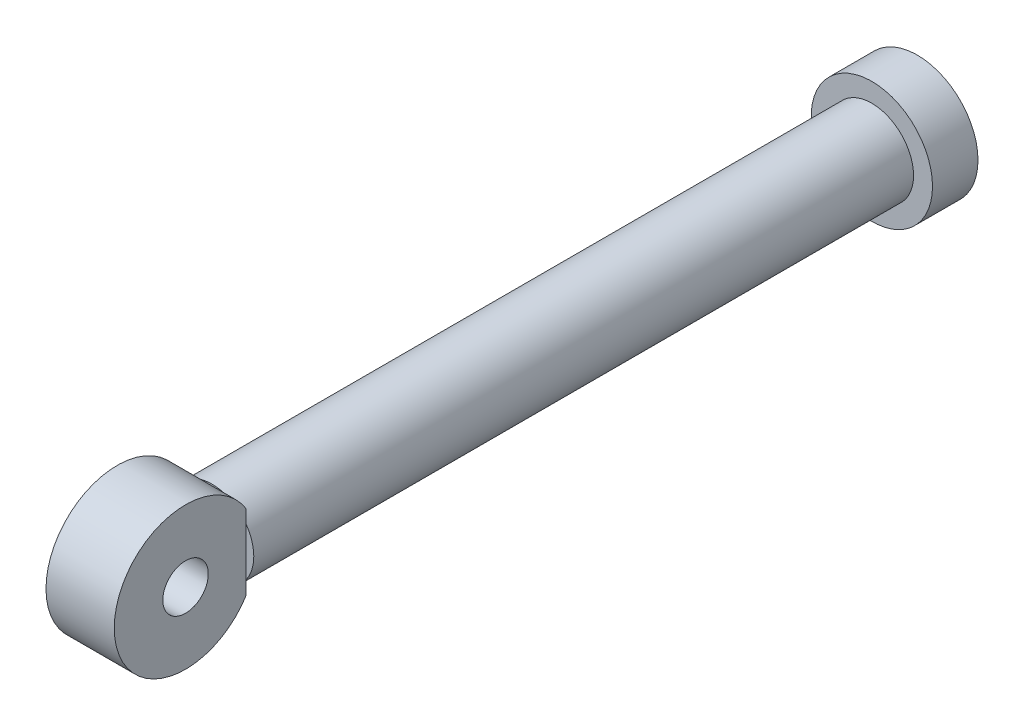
ISO-10303-21;
HEADER;
FILE_DESCRIPTION(('STEP AP214'),'2;1');
FILE_NAME('part.step','',(''),(''),'','','');
FILE_SCHEMA(('AUTOMOTIVE_DESIGN { 1 0 10303 214 1 1 1 1 }'));
ENDSEC;
DATA;
#1=APPLICATION_CONTEXT('core data for automotive mechanical design processes');
#2=APPLICATION_PROTOCOL_DEFINITION('international standard','automotive_design',2000,#1);
#3=PRODUCT_CONTEXT('',#1,'mechanical');
#4=PRODUCT('Part','Part','',(#3));
#5=PRODUCT_RELATED_PRODUCT_CATEGORY('part','',(#4));
#6=PRODUCT_DEFINITION_FORMATION('','',#4);
#7=PRODUCT_DEFINITION_CONTEXT('part definition',#1,'design');
#8=PRODUCT_DEFINITION('design','',#6,#7);
#9=PRODUCT_DEFINITION_SHAPE('','',#8);
#10=(LENGTH_UNIT() NAMED_UNIT(*) SI_UNIT(.MILLI.,.METRE.));
#11=(NAMED_UNIT(*) PLANE_ANGLE_UNIT() SI_UNIT($,.RADIAN.));
#12=(NAMED_UNIT(*) SI_UNIT($,.STERADIAN.) SOLID_ANGLE_UNIT());
#13=UNCERTAINTY_MEASURE_WITH_UNIT(LENGTH_MEASURE(1.E-05),#10,'distance_accuracy_value','');
#14=(GEOMETRIC_REPRESENTATION_CONTEXT(3) GLOBAL_UNCERTAINTY_ASSIGNED_CONTEXT((#13)) GLOBAL_UNIT_ASSIGNED_CONTEXT((#10,
#11,#12)) REPRESENTATION_CONTEXT('',''));
#15=CARTESIAN_POINT('',(0.,0.,0.));
#16=DIRECTION('',(0.,0.,1.));
#17=DIRECTION('',(1.,0.,0.));
#18=AXIS2_PLACEMENT_3D('',#15,#16,#17);
#19=CARTESIAN_POINT('',(0.,0.,465.));
#20=DIRECTION('',(0.,0.,1.));
#21=DIRECTION('',(1.,0.,0.));
#22=AXIS2_PLACEMENT_3D('',#19,#20,#21);
#23=PLANE('',#22);
#24=CARTESIAN_POINT('',(0.,0.,465.));
#25=DIRECTION('',(0.,0.,1.));
#26=DIRECTION('',(1.,0.,0.));
#27=AXIS2_PLACEMENT_3D('',#24,#25,#26);
#28=CIRCLE('',#27,27.5);
#29=CARTESIAN_POINT('',(-22.5,15.8113883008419,465.));
#30=VERTEX_POINT('',#29);
#31=CARTESIAN_POINT('',(-22.5,-15.8113883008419,465.));
#32=VERTEX_POINT('',#31);
#33=EDGE_CURVE('E150',#30,#32,#28,.T.);
#34=ORIENTED_EDGE('',*,*,#33,.T.);
#35=DIRECTION('',(0.,1.,0.));
#36=VECTOR('',#35,1.);
#37=CARTESIAN_POINT('',(-22.5,0.,465.));
#38=LINE('',#37,#36);
#39=EDGE_CURVE('E49',#32,#30,#38,.T.);
#40=ORIENTED_EDGE('',*,*,#39,.T.);
#41=EDGE_LOOP('',(#34,#40));
#42=FACE_BOUND('',#41,.T.);
#43=ADVANCED_FACE('F41',(#42),#23,.T.);
#44=CARTESIAN_POINT('',(12.1346610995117,24.6779253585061,465.));
#45=VERTEX_POINT('',#44);
#46=CARTESIAN_POINT('',(-12.1346610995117,24.6779253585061,465.));
#47=VERTEX_POINT('',#46);
#48=EDGE_CURVE('E137',#45,#47,#28,.T.);
#49=ORIENTED_EDGE('',*,*,#48,.T.);
#50=DIRECTION('',(-1.,0.,0.));
#51=VECTOR('',#50,1.);
#52=CARTESIAN_POINT('',(22.5,24.6779253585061,465.));
#53=LINE('',#52,#51);
#54=EDGE_CURVE('E145',#47,#45,#53,.F.);
#55=ORIENTED_EDGE('',*,*,#54,.T.);
#56=EDGE_LOOP('',(#49,#55));
#57=FACE_BOUND('',#56,.T.);
#58=ADVANCED_FACE('F175',(#57),#23,.T.);
#59=CARTESIAN_POINT('',(-12.1346610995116,-24.6779253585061,465.));
#60=VERTEX_POINT('',#59);
#61=CARTESIAN_POINT('',(12.1346610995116,-24.6779253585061,465.));
#62=VERTEX_POINT('',#61);
#63=EDGE_CURVE('E160',#60,#62,#28,.T.);
#64=ORIENTED_EDGE('',*,*,#63,.T.);
#65=DIRECTION('',(-1.,0.,0.));
#66=VECTOR('',#65,1.);
#67=CARTESIAN_POINT('',(22.5,-24.6779253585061,465.));
#68=LINE('',#67,#66);
#69=EDGE_CURVE('E143',#62,#60,#68,.T.);
#70=ORIENTED_EDGE('',*,*,#69,.T.);
#71=EDGE_LOOP('',(#64,#70));
#72=FACE_BOUND('',#71,.T.);
#73=ADVANCED_FACE('F177',(#72),#23,.T.);
#74=CARTESIAN_POINT('',(0.,0.,30.));
#75=DIRECTION('',(0.,0.,1.));
#76=DIRECTION('',(1.,0.,0.));
#77=AXIS2_PLACEMENT_3D('',#74,#75,#76);
#78=PLANE('',#77);
#79=CARTESIAN_POINT('',(0.,0.,30.));
#80=DIRECTION('',(0.,0.,1.));
#81=DIRECTION('',(1.,0.,0.));
#82=AXIS2_PLACEMENT_3D('',#79,#80,#81);
#83=CIRCLE('',#82,40.);
#84=CARTESIAN_POINT('',(40.,0.,30.));
#85=VERTEX_POINT('',#84);
#86=EDGE_CURVE('E140',#85,#85,#83,.T.);
#87=ORIENTED_EDGE('',*,*,#86,.T.);
#88=EDGE_LOOP('',(#87));
#89=FACE_BOUND('',#88,.T.);
#90=CARTESIAN_POINT('',(0.,0.,30.));
#91=DIRECTION('',(0.,0.,1.));
#92=DIRECTION('',(1.,0.,0.));
#93=AXIS2_PLACEMENT_3D('',#90,#91,#92);
#94=CIRCLE('',#93,27.5);
#95=CARTESIAN_POINT('',(27.5,0.,30.));
#96=VERTEX_POINT('',#95);
#97=EDGE_CURVE('E130',#96,#96,#94,.T.);
#98=ORIENTED_EDGE('',*,*,#97,.F.);
#99=EDGE_LOOP('',(#98));
#100=FACE_BOUND('',#99,.T.);
#101=ADVANCED_FACE('F183',(#89,#100),#78,.T.);
#102=CARTESIAN_POINT('',(0.,0.,30.));
#103=DIRECTION('',(0.,0.,-1.));
#104=DIRECTION('',(-1.,0.,0.));
#105=AXIS2_PLACEMENT_3D('',#102,#103,#104);
#106=CYLINDRICAL_SURFACE('',#105,40.);
#107=ORIENTED_EDGE('',*,*,#86,.F.);
#108=EDGE_LOOP('',(#107));
#109=FACE_BOUND('',#108,.T.);
#110=CARTESIAN_POINT('',(0.,0.,0.));
#111=DIRECTION('',(0.,0.,1.));
#112=DIRECTION('',(1.,0.,0.));
#113=AXIS2_PLACEMENT_3D('',#110,#111,#112);
#114=CIRCLE('',#113,40.);
#115=CARTESIAN_POINT('',(40.,0.,0.));
#116=VERTEX_POINT('',#115);
#117=EDGE_CURVE('E136',#116,#116,#114,.T.);
#118=ORIENTED_EDGE('',*,*,#117,.T.);
#119=EDGE_LOOP('',(#118));
#120=FACE_BOUND('',#119,.T.);
#121=ADVANCED_FACE('F43',(#109,#120),#106,.T.);
#122=CARTESIAN_POINT('',(0.,0.,0.));
#123=DIRECTION('',(0.,0.,1.));
#124=DIRECTION('',(1.,0.,0.));
#125=AXIS2_PLACEMENT_3D('',#122,#123,#124);
#126=PLANE('',#125);
#127=ORIENTED_EDGE('',*,*,#117,.F.);
#128=EDGE_LOOP('',(#127));
#129=FACE_BOUND('',#128,.T.);
#130=ADVANCED_FACE('F190',(#129),#126,.F.);
#131=CARTESIAN_POINT('',(0.,0.,465.));
#132=DIRECTION('',(0.,0.,-1.));
#133=DIRECTION('',(-1.,0.,0.));
#134=AXIS2_PLACEMENT_3D('',#131,#132,#133);
#135=CYLINDRICAL_SURFACE('',#134,27.5);
#136=CARTESIAN_POINT('',(22.5,15.8113883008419,465.));
#137=VERTEX_POINT('',#136);
#138=EDGE_CURVE('E134',#137,#45,#28,.T.);
#139=ORIENTED_EDGE('',*,*,#138,.F.);
#140=CARTESIAN_POINT('',(22.5,-15.8113883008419,465.));
#141=VERTEX_POINT('',#140);
#142=EDGE_CURVE('E133',#141,#137,#28,.T.);
#143=ORIENTED_EDGE('',*,*,#142,.F.);
#144=EDGE_CURVE('E162',#62,#141,#28,.T.);
#145=ORIENTED_EDGE('',*,*,#144,.F.);
#146=ORIENTED_EDGE('',*,*,#63,.F.);
#147=EDGE_CURVE('E96',#32,#60,#28,.T.);
#148=ORIENTED_EDGE('',*,*,#147,.F.);
#149=ORIENTED_EDGE('',*,*,#33,.F.);
#150=EDGE_CURVE('E157',#47,#30,#28,.T.);
#151=ORIENTED_EDGE('',*,*,#150,.F.);
#152=ORIENTED_EDGE('',*,*,#48,.F.);
#153=EDGE_LOOP('',(#139,#143,#145,#146,#148,#149,#151,#152));
#154=FACE_BOUND('',#153,.T.);
#155=ORIENTED_EDGE('',*,*,#97,.T.);
#156=EDGE_LOOP('',(#155));
#157=FACE_BOUND('',#156,.T.);
#158=ADVANCED_FACE('F154',(#154,#157),#135,.T.);
#159=DIRECTION('',(0.,1.,0.));
#160=VECTOR('',#159,1.);
#161=CARTESIAN_POINT('',(22.5,0.,465.));
#162=LINE('',#161,#160);
#163=EDGE_CURVE('E11',#141,#137,#162,.T.);
#164=ORIENTED_EDGE('',*,*,#163,.F.);
#165=ORIENTED_EDGE('',*,*,#142,.T.);
#166=EDGE_LOOP('',(#164,#165));
#167=FACE_BOUND('',#166,.T.);
#168=ADVANCED_FACE('F170',(#167),#23,.T.);
#169=CARTESIAN_POINT('',(22.5,24.6779253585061,465.));
#170=DIRECTION('',(0.,0.,1.));
#171=DIRECTION('',(1.,0.,0.));
#172=AXIS2_PLACEMENT_3D('',#169,#170,#171);
#173=PLANE('',#172);
#174=DIRECTION('',(0.,1.,0.));
#175=VECTOR('',#174,1.);
#176=CARTESIAN_POINT('',(22.5,24.6779253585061,465.));
#177=LINE('',#176,#175);
#178=CARTESIAN_POINT('',(22.5,24.6779253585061,465.));
#179=VERTEX_POINT('',#178);
#180=EDGE_CURVE('E64',#137,#179,#177,.T.);
#181=ORIENTED_EDGE('',*,*,#180,.F.);
#182=ORIENTED_EDGE('',*,*,#138,.T.);
#183=DIRECTION('',(-1.,0.,0.));
#184=VECTOR('',#183,1.);
#185=CARTESIAN_POINT('',(22.5,24.6779253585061,465.));
#186=LINE('',#185,#184);
#187=EDGE_CURVE('E99',#179,#45,#186,.T.);
#188=ORIENTED_EDGE('',*,*,#187,.F.);
#189=EDGE_LOOP('',(#181,#182,#188));
#190=FACE_BOUND('',#189,.T.);
#191=ADVANCED_FACE('F171',(#190),#173,.F.);
#192=CARTESIAN_POINT('',(-22.5,24.6779253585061,465.));
#193=VERTEX_POINT('',#192);
#194=EDGE_CURVE('E114',#47,#193,#186,.T.);
#195=ORIENTED_EDGE('',*,*,#194,.F.);
#196=ORIENTED_EDGE('',*,*,#150,.T.);
#197=DIRECTION('',(0.,1.,0.));
#198=VECTOR('',#197,1.);
#199=CARTESIAN_POINT('',(-22.5,24.6779253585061,465.));
#200=LINE('',#199,#198);
#201=EDGE_CURVE('E109',#30,#193,#200,.T.);
#202=ORIENTED_EDGE('',*,*,#201,.T.);
#203=EDGE_LOOP('',(#195,#196,#202));
#204=FACE_BOUND('',#203,.T.);
#205=ADVANCED_FACE('F237',(#204),#173,.F.);
#206=CARTESIAN_POINT('',(-22.5,-24.6779253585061,465.));
#207=VERTEX_POINT('',#206);
#208=EDGE_CURVE('E94',#207,#32,#200,.T.);
#209=ORIENTED_EDGE('',*,*,#208,.T.);
#210=ORIENTED_EDGE('',*,*,#147,.T.);
#211=DIRECTION('',(-1.,0.,0.));
#212=VECTOR('',#211,1.);
#213=CARTESIAN_POINT('',(22.5,-24.6779253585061,465.));
#214=LINE('',#213,#212);
#215=EDGE_CURVE('E56',#60,#207,#214,.T.);
#216=ORIENTED_EDGE('',*,*,#215,.T.);
#217=EDGE_LOOP('',(#209,#210,#216));
#218=FACE_BOUND('',#217,.T.);
#219=ADVANCED_FACE('F93',(#218),#173,.F.);
#220=CARTESIAN_POINT('',(22.5,-24.6779253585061,465.));
#221=VERTEX_POINT('',#220);
#222=EDGE_CURVE('E98',#221,#62,#214,.T.);
#223=ORIENTED_EDGE('',*,*,#222,.T.);
#224=ORIENTED_EDGE('',*,*,#144,.T.);
#225=EDGE_CURVE('E124',#221,#141,#177,.T.);
#226=ORIENTED_EDGE('',*,*,#225,.F.);
#227=EDGE_LOOP('',(#223,#224,#226));
#228=FACE_BOUND('',#227,.T.);
#229=ADVANCED_FACE('F238',(#228),#173,.F.);
#230=CARTESIAN_POINT('',(22.5,0.,505.));
#231=DIRECTION('',(1.,0.,0.));
#232=DIRECTION('',(0.,0.,-1.));
#233=AXIS2_PLACEMENT_3D('',#230,#231,#232);
#234=PLANE('',#233);
#235=CARTESIAN_POINT('',(22.5,0.,505.));
#236=DIRECTION('',(1.,0.,0.));
#237=DIRECTION('',(0.,0.,-1.));
#238=AXIS2_PLACEMENT_3D('',#235,#236,#237);
#239=CIRCLE('',#238,47.);
#240=EDGE_CURVE('E108',#179,#221,#239,.T.);
#241=ORIENTED_EDGE('',*,*,#240,.T.);
#242=ORIENTED_EDGE('',*,*,#225,.T.);
#243=ORIENTED_EDGE('',*,*,#163,.T.);
#244=ORIENTED_EDGE('',*,*,#180,.T.);
#245=EDGE_LOOP('',(#241,#242,#243,#244));
#246=FACE_BOUND('',#245,.T.);
#247=CARTESIAN_POINT('',(22.5,0.,505.));
#248=DIRECTION('',(1.,0.,0.));
#249=DIRECTION('',(0.,0.,-1.));
#250=AXIS2_PLACEMENT_3D('',#247,#248,#249);
#251=CIRCLE('',#250,15.);
#252=CARTESIAN_POINT('',(22.5,0.,520.));
#253=VERTEX_POINT('',#252);
#254=EDGE_CURVE('E115',#253,#253,#251,.T.);
#255=ORIENTED_EDGE('',*,*,#254,.F.);
#256=EDGE_LOOP('',(#255));
#257=FACE_BOUND('',#256,.T.);
#258=ADVANCED_FACE('F255',(#246,#257),#234,.T.);
#259=CARTESIAN_POINT('',(-22.5,0.,505.));
#260=DIRECTION('',(1.,0.,0.));
#261=DIRECTION('',(0.,0.,-1.));
#262=AXIS2_PLACEMENT_3D('',#259,#260,#261);
#263=PLANE('',#262);
#264=CARTESIAN_POINT('',(-22.5,0.,505.));
#265=DIRECTION('',(1.,0.,0.));
#266=DIRECTION('',(0.,0.,-1.));
#267=AXIS2_PLACEMENT_3D('',#264,#265,#266);
#268=CIRCLE('',#267,47.);
#269=EDGE_CURVE('E106',#193,#207,#268,.T.);
#270=ORIENTED_EDGE('',*,*,#269,.F.);
#271=ORIENTED_EDGE('',*,*,#201,.F.);
#272=ORIENTED_EDGE('',*,*,#39,.F.);
#273=ORIENTED_EDGE('',*,*,#208,.F.);
#274=EDGE_LOOP('',(#270,#271,#272,#273));
#275=FACE_BOUND('',#274,.T.);
#276=CARTESIAN_POINT('',(-22.5,0.,505.));
#277=DIRECTION('',(1.,0.,0.));
#278=DIRECTION('',(0.,0.,-1.));
#279=AXIS2_PLACEMENT_3D('',#276,#277,#278);
#280=CIRCLE('',#279,15.);
#281=CARTESIAN_POINT('',(-22.5,0.,520.));
#282=VERTEX_POINT('',#281);
#283=EDGE_CURVE('E118',#282,#282,#280,.T.);
#284=ORIENTED_EDGE('',*,*,#283,.T.);
#285=EDGE_LOOP('',(#284));
#286=FACE_BOUND('',#285,.T.);
#287=ADVANCED_FACE('F103',(#275,#286),#263,.F.);
#288=CARTESIAN_POINT('',(22.5,0.,505.));
#289=DIRECTION('',(-1.,0.,0.));
#290=DIRECTION('',(0.,0.,1.));
#291=AXIS2_PLACEMENT_3D('',#288,#289,#290);
#292=CYLINDRICAL_SURFACE('',#291,47.);
#293=ORIENTED_EDGE('',*,*,#269,.T.);
#294=ORIENTED_EDGE('',*,*,#215,.F.);
#295=ORIENTED_EDGE('',*,*,#69,.F.);
#296=ORIENTED_EDGE('',*,*,#222,.F.);
#297=ORIENTED_EDGE('',*,*,#240,.F.);
#298=ORIENTED_EDGE('',*,*,#187,.T.);
#299=ORIENTED_EDGE('',*,*,#54,.F.);
#300=ORIENTED_EDGE('',*,*,#194,.T.);
#301=EDGE_LOOP('',(#293,#294,#295,#296,#297,#298,#299,#300));
#302=FACE_BOUND('',#301,.T.);
#303=ADVANCED_FACE('F112',(#302),#292,.T.);
#304=CARTESIAN_POINT('',(22.5,0.,505.));
#305=DIRECTION('',(-1.,0.,0.));
#306=DIRECTION('',(0.,0.,1.));
#307=AXIS2_PLACEMENT_3D('',#304,#305,#306);
#308=CYLINDRICAL_SURFACE('',#307,15.);
#309=CARTESIAN_POINT('',(22.5,0.,520.));
#310=CARTESIAN_POINT('',(22.03125,0.,520.));
#311=CARTESIAN_POINT('',(21.5625,0.,520.));
#312=CARTESIAN_POINT('',(20.625,0.,520.));
#313=CARTESIAN_POINT('',(20.15625,0.,520.));
#314=CARTESIAN_POINT('',(19.21875,0.,520.));
#315=CARTESIAN_POINT('',(18.75,0.,520.));
#316=CARTESIAN_POINT('',(17.8125,0.,520.));
#317=CARTESIAN_POINT('',(17.34375,0.,520.));
#318=CARTESIAN_POINT('',(16.40625,0.,520.));
#319=CARTESIAN_POINT('',(15.9375,0.,520.));
#320=CARTESIAN_POINT('',(15.,0.,520.));
#321=CARTESIAN_POINT('',(14.53125,0.,520.));
#322=CARTESIAN_POINT('',(13.59375,0.,520.));
#323=CARTESIAN_POINT('',(13.125,0.,520.));
#324=CARTESIAN_POINT('',(12.1875,0.,520.));
#325=CARTESIAN_POINT('',(11.71875,0.,520.));
#326=CARTESIAN_POINT('',(10.78125,0.,520.));
#327=CARTESIAN_POINT('',(10.3125,0.,520.));
#328=CARTESIAN_POINT('',(9.37499999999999,0.,520.));
#329=CARTESIAN_POINT('',(8.90625,0.,520.));
#330=CARTESIAN_POINT('',(7.96874999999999,0.,520.));
#331=CARTESIAN_POINT('',(7.5,0.,520.));
#332=CARTESIAN_POINT('',(6.5625,0.,520.));
#333=CARTESIAN_POINT('',(6.09375,0.,520.));
#334=CARTESIAN_POINT('',(5.15625,0.,520.));
#335=CARTESIAN_POINT('',(4.6875,0.,520.));
#336=CARTESIAN_POINT('',(3.75,0.,520.));
#337=CARTESIAN_POINT('',(3.28125,0.,520.));
#338=CARTESIAN_POINT('',(2.34375,0.,520.));
#339=CARTESIAN_POINT('',(1.875,0.,520.));
#340=CARTESIAN_POINT('',(0.937499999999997,0.,520.));
#341=CARTESIAN_POINT('',(0.468749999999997,0.,520.));
#342=CARTESIAN_POINT('',(-0.468750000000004,0.,520.));
#343=CARTESIAN_POINT('',(-0.937500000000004,0.,520.));
#344=CARTESIAN_POINT('',(-1.87500000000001,0.,520.));
#345=CARTESIAN_POINT('',(-2.34375000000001,0.,520.));
#346=CARTESIAN_POINT('',(-3.28125,0.,520.));
#347=CARTESIAN_POINT('',(-3.75,0.,520.));
#348=CARTESIAN_POINT('',(-4.6875,0.,520.));
#349=CARTESIAN_POINT('',(-5.15625,0.,520.));
#350=CARTESIAN_POINT('',(-6.09375000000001,0.,520.));
#351=CARTESIAN_POINT('',(-6.56250000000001,0.,520.));
#352=CARTESIAN_POINT('',(-7.50000000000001,0.,520.));
#353=CARTESIAN_POINT('',(-7.96875000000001,0.,520.));
#354=CARTESIAN_POINT('',(-8.90625,0.,520.));
#355=CARTESIAN_POINT('',(-9.37500000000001,0.,520.));
#356=CARTESIAN_POINT('',(-10.3125,0.,520.));
#357=CARTESIAN_POINT('',(-10.78125,0.,520.));
#358=CARTESIAN_POINT('',(-11.71875,0.,520.));
#359=CARTESIAN_POINT('',(-12.1875,0.,520.));
#360=CARTESIAN_POINT('',(-13.125,0.,520.));
#361=CARTESIAN_POINT('',(-13.59375,0.,520.));
#362=CARTESIAN_POINT('',(-14.53125,0.,520.));
#363=CARTESIAN_POINT('',(-15.,0.,520.));
#364=CARTESIAN_POINT('',(-15.9375,0.,520.));
#365=CARTESIAN_POINT('',(-16.40625,0.,520.));
#366=CARTESIAN_POINT('',(-17.34375,0.,520.));
#367=CARTESIAN_POINT('',(-17.8125,0.,520.));
#368=CARTESIAN_POINT('',(-18.75,0.,520.));
#369=CARTESIAN_POINT('',(-19.21875,0.,520.));
#370=CARTESIAN_POINT('',(-20.15625,0.,520.));
#371=CARTESIAN_POINT('',(-20.625,0.,520.));
#372=CARTESIAN_POINT('',(-21.5625,0.,520.));
#373=CARTESIAN_POINT('',(-22.03125,0.,520.));
#374=CARTESIAN_POINT('',(-22.5,0.,520.));
#375=B_SPLINE_CURVE_WITH_KNOTS('',3,(#309,#310,#311,#312,#313,#314,#315,#316,#317,#318,#319,
#320,#321,#322,#323,#324,#325,#326,#327,#328,#329,#330,#331,#332,#333,#334,#335,#336,#337,#338,
#339,#340,#341,#342,#343,#344,#345,#346,#347,#348,#349,#350,#351,#352,#353,#354,#355,#356,#357,
#358,#359,#360,#361,#362,#363,#364,#365,#366,#367,#368,#369,#370,#371,#372,#373,#374),
.UNSPECIFIED.,.F.,.F.,(4,2,2,2,2,2,2,2,2,2,2,2,2,2,2,2,2,2,2,2,2,2,2,2,2,2,2,2,2,2,2,2,4),(0.,
1.40625,2.8125,4.21875,5.625,7.03125,8.4375,9.84375,11.25,12.65625,14.0625,15.46875,16.875,
18.28125,19.6875,21.09375,22.5,23.90625,25.3125,26.71875,28.125,29.53125,30.9375,32.34375,33.75,
35.15625,36.5625,37.96875,39.375,40.78125,42.1875,43.59375,45.),.UNSPECIFIED.);
#376=EDGE_CURVE('BSEAM274',#253,#282,#375,.T.);
#377=ORIENTED_EDGE('',*,*,#254,.T.);
#378=ORIENTED_EDGE('',*,*,#283,.F.);
#379=ORIENTED_EDGE('',*,*,#376,.T.);
#380=ORIENTED_EDGE('',*,*,#376,.F.);
#381=EDGE_LOOP('',(#377,#379,#378,#380));
#382=FACE_BOUND('',#381,.T.);
#383=ADVANCED_FACE('F274',(#382),#308,.F.);
#384=CLOSED_SHELL('',(#43,#58,#73,#101,#121,#130,#158,#168,#191,#205,#219,#229,#258,#287,#303,#383));
#385=MANIFOLD_SOLID_BREP('B2',#384);
#386=ADVANCED_BREP_SHAPE_REPRESENTATION('',(#18,#385),#14);
#387=SHAPE_DEFINITION_REPRESENTATION(#9,#386);
ENDSEC;
END-ISO-10303-21;
